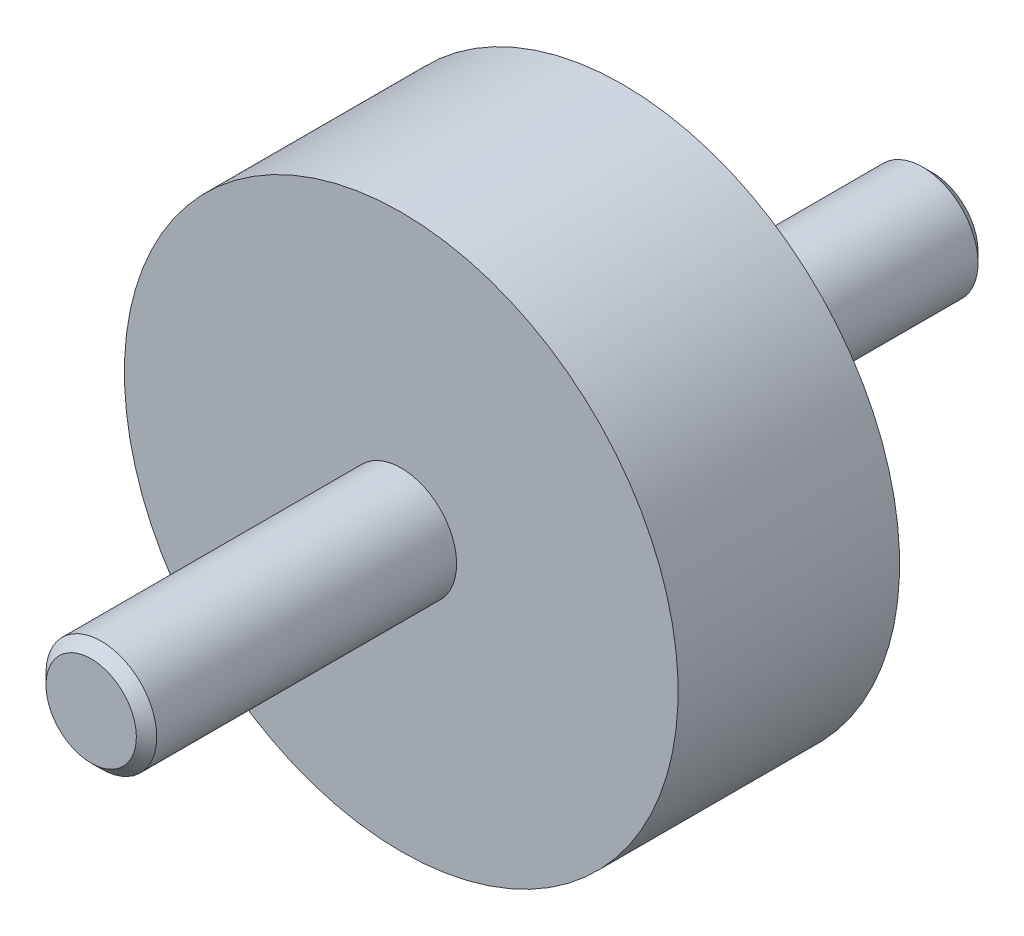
ISO-10303-21;
HEADER;
FILE_DESCRIPTION(('STEP AP214'),'2;1');
FILE_NAME('part.step','',(''),(''),'','','');
FILE_SCHEMA(('AUTOMOTIVE_DESIGN { 1 0 10303 214 1 1 1 1 }'));
ENDSEC;
DATA;
#1=APPLICATION_CONTEXT('core data for automotive mechanical design processes');
#2=APPLICATION_PROTOCOL_DEFINITION('international standard','automotive_design',2000,#1);
#3=PRODUCT_CONTEXT('',#1,'mechanical');
#4=PRODUCT('Part','Part','',(#3));
#5=PRODUCT_RELATED_PRODUCT_CATEGORY('part','',(#4));
#6=PRODUCT_DEFINITION_FORMATION('','',#4);
#7=PRODUCT_DEFINITION_CONTEXT('part definition',#1,'design');
#8=PRODUCT_DEFINITION('design','',#6,#7);
#9=PRODUCT_DEFINITION_SHAPE('','',#8);
#10=(LENGTH_UNIT() NAMED_UNIT(*) SI_UNIT(.MILLI.,.METRE.));
#11=(NAMED_UNIT(*) PLANE_ANGLE_UNIT() SI_UNIT($,.RADIAN.));
#12=(NAMED_UNIT(*) SI_UNIT($,.STERADIAN.) SOLID_ANGLE_UNIT());
#13=UNCERTAINTY_MEASURE_WITH_UNIT(LENGTH_MEASURE(1.E-05),#10,'distance_accuracy_value','');
#14=(GEOMETRIC_REPRESENTATION_CONTEXT(3) GLOBAL_UNCERTAINTY_ASSIGNED_CONTEXT((#13)) GLOBAL_UNIT_ASSIGNED_CONTEXT((#10,
#11,#12)) REPRESENTATION_CONTEXT('',''));
#15=CARTESIAN_POINT('',(0.,0.,0.));
#16=DIRECTION('',(0.,0.,1.));
#17=DIRECTION('',(1.,0.,0.));
#18=AXIS2_PLACEMENT_3D('',#15,#16,#17);
#19=CARTESIAN_POINT('',(23.333333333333,0.,20.));
#20=DIRECTION('',(0.,0.,1.));
#21=DIRECTION('',(0.,-1.,0.));
#22=AXIS2_PLACEMENT_3D('',#19,#20,#21);
#23=PLANE('',#22);
#24=CARTESIAN_POINT('',(0.,0.,20.));
#25=DIRECTION('',(0.,0.,1.));
#26=DIRECTION('',(0.,-1.,0.));
#27=AXIS2_PLACEMENT_3D('',#24,#25,#26);
#28=CIRCLE('',#27,5.);
#29=CARTESIAN_POINT('',(0.,-5.,20.));
#30=VERTEX_POINT('',#29);
#31=EDGE_CURVE('E8',#30,#30,#28,.T.);
#32=ORIENTED_EDGE('',*,*,#31,.F.);
#33=EDGE_LOOP('',(#32));
#34=FACE_BOUND('',#33,.T.);
#35=CARTESIAN_POINT('',(0.,0.,20.));
#36=DIRECTION('',(0.,0.,1.));
#37=DIRECTION('',(0.,-1.,0.));
#38=AXIS2_PLACEMENT_3D('',#35,#36,#37);
#39=CIRCLE('',#38,25.);
#40=CARTESIAN_POINT('',(0.,-25.,20.));
#41=VERTEX_POINT('',#40);
#42=EDGE_CURVE('E22',#41,#41,#39,.T.);
#43=ORIENTED_EDGE('',*,*,#42,.T.);
#44=EDGE_LOOP('',(#43));
#45=FACE_BOUND('',#44,.T.);
#46=ADVANCED_FACE('F12',(#34,#45),#23,.T.);
#47=CARTESIAN_POINT('',(0.,0.,0.66666666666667));
#48=DIRECTION('',(0.,0.,1.));
#49=DIRECTION('',(0.,-1.,0.));
#50=AXIS2_PLACEMENT_3D('',#47,#48,#49);
#51=CYLINDRICAL_SURFACE('',#50,25.);
#52=CARTESIAN_POINT('',(0.,0.,0.));
#53=DIRECTION('',(0.,0.,1.));
#54=DIRECTION('',(0.,-1.,0.));
#55=AXIS2_PLACEMENT_3D('',#52,#53,#54);
#56=CIRCLE('',#55,25.);
#57=CARTESIAN_POINT('',(0.,-25.,0.));
#58=VERTEX_POINT('',#57);
#59=EDGE_CURVE('E26',#58,#58,#56,.T.);
#60=ORIENTED_EDGE('',*,*,#59,.T.);
#61=EDGE_LOOP('',(#60));
#62=FACE_BOUND('',#61,.T.);
#63=ORIENTED_EDGE('',*,*,#42,.F.);
#64=EDGE_LOOP('',(#63));
#65=FACE_BOUND('',#64,.T.);
#66=ADVANCED_FACE('F57',(#62,#65),#51,.T.);
#67=CARTESIAN_POINT('',(25.,0.,0.));
#68=DIRECTION('',(0.,0.,-1.));
#69=DIRECTION('',(0.,1.,0.));
#70=AXIS2_PLACEMENT_3D('',#67,#68,#69);
#71=PLANE('',#70);
#72=CARTESIAN_POINT('',(0.,0.,0.));
#73=DIRECTION('',(0.,0.,-1.));
#74=DIRECTION('',(0.,1.,0.));
#75=AXIS2_PLACEMENT_3D('',#72,#73,#74);
#76=CIRCLE('',#75,5.);
#77=CARTESIAN_POINT('',(0.,5.,0.));
#78=VERTEX_POINT('',#77);
#79=EDGE_CURVE('E18',#78,#78,#76,.T.);
#80=ORIENTED_EDGE('',*,*,#79,.F.);
#81=EDGE_LOOP('',(#80));
#82=FACE_BOUND('',#81,.T.);
#83=ORIENTED_EDGE('',*,*,#59,.F.);
#84=EDGE_LOOP('',(#83));
#85=FACE_BOUND('',#84,.T.);
#86=ADVANCED_FACE('F62',(#82,#85),#71,.T.);
#87=CARTESIAN_POINT('',(0.,0.,-28.));
#88=DIRECTION('',(0.,0.,1.));
#89=DIRECTION('',(0.,-1.,0.));
#90=AXIS2_PLACEMENT_3D('',#87,#88,#89);
#91=CYLINDRICAL_SURFACE('',#90,5.);
#92=CARTESIAN_POINT('',(0.,0.,-27.08));
#93=DIRECTION('',(0.,0.,1.));
#94=DIRECTION('',(0.,-1.,0.));
#95=AXIS2_PLACEMENT_3D('',#92,#93,#94);
#96=CIRCLE('',#95,5.);
#97=CARTESIAN_POINT('',(0.,-5.,-27.08));
#98=VERTEX_POINT('',#97);
#99=EDGE_CURVE('E31',#98,#98,#96,.T.);
#100=ORIENTED_EDGE('',*,*,#99,.T.);
#101=EDGE_LOOP('',(#100));
#102=FACE_BOUND('',#101,.T.);
#103=ORIENTED_EDGE('',*,*,#79,.T.);
#104=EDGE_LOOP('',(#103));
#105=FACE_BOUND('',#104,.T.);
#106=ADVANCED_FACE('F70',(#102,#105),#91,.T.);
#107=CARTESIAN_POINT('',(0.,0.,-27.08));
#108=DIRECTION('',(0.,0.,1.));
#109=DIRECTION('',(0.,-1.,0.));
#110=AXIS2_PLACEMENT_3D('',#107,#108,#109);
#111=CONICAL_SURFACE('',#110,5.,0.785398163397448);
#112=CARTESIAN_POINT('',(0.,0.,-28.));
#113=DIRECTION('',(0.,0.,1.));
#114=DIRECTION('',(0.,-1.,0.));
#115=AXIS2_PLACEMENT_3D('',#112,#113,#114);
#116=CIRCLE('',#115,4.08);
#117=CARTESIAN_POINT('',(0.,-4.08,-28.));
#118=VERTEX_POINT('',#117);
#119=EDGE_CURVE('E34',#118,#118,#116,.T.);
#120=ORIENTED_EDGE('',*,*,#119,.T.);
#121=EDGE_LOOP('',(#120));
#122=FACE_BOUND('',#121,.T.);
#123=ORIENTED_EDGE('',*,*,#99,.F.);
#124=EDGE_LOOP('',(#123));
#125=FACE_BOUND('',#124,.T.);
#126=ADVANCED_FACE('F76',(#122,#125),#111,.T.);
#127=CARTESIAN_POINT('',(4.08,0.,-28.));
#128=DIRECTION('',(0.,0.,-1.));
#129=DIRECTION('',(0.,1.,0.));
#130=AXIS2_PLACEMENT_3D('',#127,#128,#129);
#131=PLANE('',#130);
#132=ORIENTED_EDGE('',*,*,#119,.F.);
#133=EDGE_LOOP('',(#132));
#134=FACE_BOUND('',#133,.T.);
#135=ADVANCED_FACE('F80',(#134),#131,.T.);
#136=CARTESIAN_POINT('',(0.,0.,48.));
#137=DIRECTION('',(0.,0.,1.));
#138=DIRECTION('',(0.,-1.,0.));
#139=AXIS2_PLACEMENT_3D('',#136,#137,#138);
#140=PLANE('',#139);
#141=CARTESIAN_POINT('',(0.,0.,48.));
#142=DIRECTION('',(0.,0.,1.));
#143=DIRECTION('',(0.,-1.,0.));
#144=AXIS2_PLACEMENT_3D('',#141,#142,#143);
#145=CIRCLE('',#144,4.08);
#146=CARTESIAN_POINT('',(0.,-4.08,48.));
#147=VERTEX_POINT('',#146);
#148=EDGE_CURVE('E37',#147,#147,#145,.T.);
#149=ORIENTED_EDGE('',*,*,#148,.T.);
#150=EDGE_LOOP('',(#149));
#151=FACE_BOUND('',#150,.T.);
#152=ADVANCED_FACE('F54',(#151),#140,.T.);
#153=CARTESIAN_POINT('',(0.,0.,48.));
#154=DIRECTION('',(0.,0.,-1.));
#155=DIRECTION('',(0.,1.,0.));
#156=AXIS2_PLACEMENT_3D('',#153,#154,#155);
#157=CONICAL_SURFACE('',#156,4.08,0.785398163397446);
#158=CARTESIAN_POINT('',(0.,0.,47.08));
#159=DIRECTION('',(0.,0.,1.));
#160=DIRECTION('',(0.,-1.,0.));
#161=AXIS2_PLACEMENT_3D('',#158,#159,#160);
#162=CIRCLE('',#161,5.);
#163=CARTESIAN_POINT('',(0.,-5.,47.08));
#164=VERTEX_POINT('',#163);
#165=EDGE_CURVE('E40',#164,#164,#162,.T.);
#166=ORIENTED_EDGE('',*,*,#165,.T.);
#167=EDGE_LOOP('',(#166));
#168=FACE_BOUND('',#167,.T.);
#169=ORIENTED_EDGE('',*,*,#148,.F.);
#170=EDGE_LOOP('',(#169));
#171=FACE_BOUND('',#170,.T.);
#172=ADVANCED_FACE('F44',(#168,#171),#157,.T.);
#173=CARTESIAN_POINT('',(0.,0.,20.));
#174=DIRECTION('',(0.,0.,1.));
#175=DIRECTION('',(0.,-1.,0.));
#176=AXIS2_PLACEMENT_3D('',#173,#174,#175);
#177=CYLINDRICAL_SURFACE('',#176,5.);
#178=ORIENTED_EDGE('',*,*,#31,.T.);
#179=EDGE_LOOP('',(#178));
#180=FACE_BOUND('',#179,.T.);
#181=ORIENTED_EDGE('',*,*,#165,.F.);
#182=EDGE_LOOP('',(#181));
#183=FACE_BOUND('',#182,.T.);
#184=ADVANCED_FACE('F47',(#180,#183),#177,.T.);
#185=CLOSED_SHELL('',(#46,#66,#86,#106,#126,#135,#152,#172,#184));
#186=MANIFOLD_SOLID_BREP('B1',#185);
#187=ADVANCED_BREP_SHAPE_REPRESENTATION('',(#18,#186),#14);
#188=SHAPE_DEFINITION_REPRESENTATION(#9,#187);
ENDSEC;
END-ISO-10303-21;
